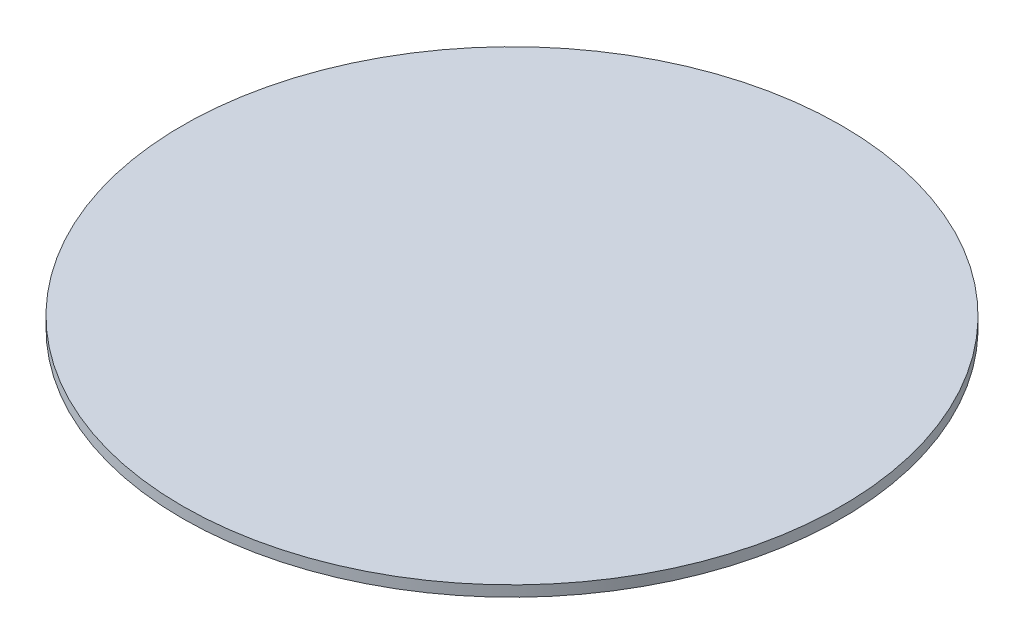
from build123d import *


with BuildPart() as part:
    # Sketch1 → Revolve1 (revolve)
    with BuildSketch(Plane.XY, mode=Mode.PRIVATE) as revolve1_sk:
        with BuildLine():
            Line((-155.575, 0), (-155.575, 5.08))
            Line((-155.575, 5.08), (0, 5.08))
            Line((0, 5.08), (0, 0))
            Line((0, 0), (-109.22, 0))
            ThreePointArc((-109.22, 0), (-116.404204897, -2.975795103), (-119.38, -10.16))
            Line((-119.38, -10.16), (-119.38, -12.7))
            Line((-119.38, -12.7), (-127, -12.7))
            Line((-127, -12.7), (-127, 0))
            Line((-127, 0), (-155.575, 0))
        make_face()
    revolve(revolve1_sk.sketch.rotate(Axis((0, 0, 0), (0, 1, 0)), 270), axis=Axis((0, 0, 0), (0, 1, 0)))


solid = part.part
